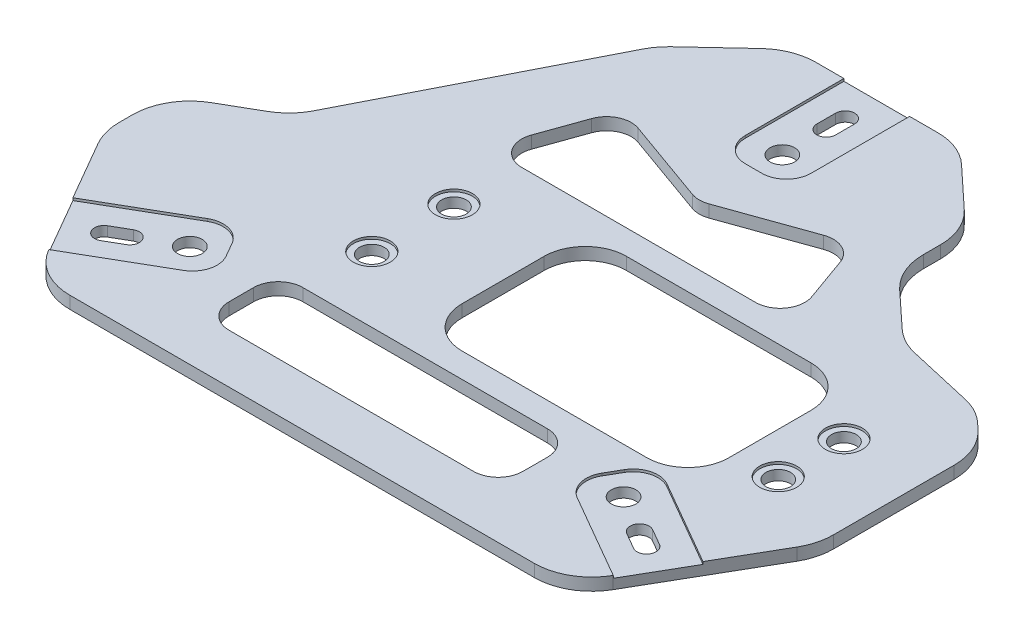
from build123d import *

# Parameters (mm, degrees)
BOSS_EXTRUDE1_DEPTH                     = 0.75
BOSS_EXTRUDE1_DEPTH_BACK                = 0.75
FILLET_7MM_R                            = 7
FILLET_8MM_R                            = 7
GROOVES_START                           = -0.3
GROOVES_DEPTH                           = 61.785535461
SKETCH6_R                               = 1.5
COPPERROD_HOLES_DEPTH                   = 61.478839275
CIRPATTERN1_COUNT                       = 3
SKETCH9_W                               = 32.5
SKETCH9_H                               = 20
SKETCH9_W_2                             = 35.79
SKETCH9_H_2                             = 9
CUT_EXTRUDE3_DEPTH                      = 61.485535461
FILLET_5MM_R                            = 5
FILLET_3MM_R                            = 3
CBORE_FOR_M5_HEX_HEAD_BOLT1_D           = 3
CBORE_FOR_M5_HEX_HEAD_BOLT1_CBORE_D     = 4.5
CBORE_FOR_M5_HEX_HEAD_BOLT1_CBORE_DEPTH = 0.3


with BuildPart() as part:
    # Sketch5 → Boss-Extrude1 (new, two sides: drawn at the far end of the back side and taken through both)
    with BuildSketch(Plane(origin=(0, 0, 0), x_dir=(1, 0, 0), z_dir=(0, 1, 0)).offset(-BOSS_EXTRUDE1_DEPTH_BACK)):
        Polygon((-32.33, -28), (32.33, -28), (43.5, -8.652992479), (43.5, 10.937007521), (39.109866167, 15.114366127), (27.41180038, 17.789297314), (19.417173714, 25.213180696), (19.417173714, 33.393180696), (10.18749, 42), (-10.18749, 42), (-18.785888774, 33.9772113), (-33.80897843, 4.471637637), (-43.5, -1.102992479), (-43.5, -8.652992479), align=None)
    extrude(amount=BOSS_EXTRUDE1_DEPTH + BOSS_EXTRUDE1_DEPTH_BACK)

    # Fillet_7mm
    fillet_7mm_edges = [part.edges().sort_by_distance(p)[0] for p in [
        (-43.5, 0, 8.652992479),
        (-10.18749, 0, -42),
        (10.18749, 0, -42),
        (43.5, 0, -10.937007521),
        (43.5, 0, 8.652992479),
        (32.33, 0, 28),
        (-32.33, 0, 28),
    ]]
    fillet(fillet_7mm_edges, radius=FILLET_7MM_R)

    # Fillet_8mm
    fillet_8mm_edges = [part.edges().sort_by_distance(p)[0] for p in [
        (-43.5, 0, 1.102992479),
        (-33.80897843, 0, -4.471637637),
        (-18.785888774, 0, -33.9772113),
        (19.417173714, 0, -33.393180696),
        (19.417173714, 0, -25.213180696),
        (27.41180038, 0, -17.789297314),
        (39.109866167, 0, -15.114366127),
    ]]
    fillet(fillet_8mm_edges, radius=FILLET_8MM_R)

    # Sketch7 → Grooves (cut)
    with BuildSketch(Plane(origin=(0, 0.75, 0), x_dir=(1, 0, 0), z_dir=(0, 1, 0)).offset(GROOVES_START)):
        with BuildLine():
            Line((-0.999540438, 27.000000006), (0.000376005, 27.000000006))
            Line((0.000376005, 27.000000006), (0.000584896, 42))
            Line((0.000584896, 42), (-3.999206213, 42))
            Line((-3.999206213, 42), (-3.999540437, 30.000083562))
            ThreePointArc((-3.999540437, 30.000083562), (-3.120890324, 27.878709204), (-0.999540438, 27.000000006))
        make_face()
        with BuildLine():
            Line((0.000584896, 42), (0.000376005, 27.000000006))
            Line((0.000376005, 27.000000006), (1.000376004, 27.000000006))
            ThreePointArc((1.000376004, 27.000000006), (3.121696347, 27.878679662), (4.000376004, 30.000000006))
            Line((4.000376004, 30.000000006), (4.000376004, 42))
            Line((4.000376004, 42), (0.000584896, 42))
        make_face()
    grooves = extrude(amount=GROOVES_DEPTH, mode=Mode.SUBTRACT)

    # Sketch6 → CopperRod_Holes (cut, through all)
    with BuildSketch(Plane(origin=(0, 0.45, 0), x_dir=(1, 0, 0), z_dir=(0, 1, 0))):
        with Locations(Location((0, 30.5, 0), (0, 0, 270))):
            Circle(SKETCH6_R)
        with BuildLine():
            Line((1.15, 35.85), (1.15, 38.15))
            ThreePointArc((1.15, 38.15), (0, 39.3), (-1.15, 38.15))
            Line((-1.15, 38.15), (-1.15, 35.85))
            ThreePointArc((-1.15, 35.85), (0, 34.7), (1.15, 35.85))
        make_face()
    copperrod_holes = extrude(amount=-COPPERROD_HOLES_DEPTH, mode=Mode.SUBTRACT)

    # CirPattern1: Grooves, CopperRod_Holes ×3 about axis
    cirpattern1_axis = Axis((0, 0, 0), (0, 1, 0))
    add([grooves.rotate(cirpattern1_axis, i * 360 / CIRPATTERN1_COUNT) for i in range(1, CIRPATTERN1_COUNT)], mode=Mode.SUBTRACT)
    add([copperrod_holes.rotate(cirpattern1_axis, i * 360 / CIRPATTERN1_COUNT) for i in range(1, CIRPATTERN1_COUNT)], mode=Mode.SUBTRACT)

    # Sketch9 → Cut-Extrude3 (cut, through all)
    with BuildSketch(Plane(origin=(0, 0.75, 0), x_dir=(1, 0, 0), z_dir=(0, 1, 0))):
        with Locations((12.75, 0)):
            Rectangle(SKETCH9_W, SKETCH9_H)
        with Locations((0, -17.5)):
            Rectangle(SKETCH9_W_2, SKETCH9_H_2)
        Polygon((-18.5, 13), (18.5, 13), (14.125077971, 25.241734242), (0, 20.193747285), (-14.125077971, 25.241734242), align=None)
    extrude(amount=-CUT_EXTRUDE3_DEPTH, mode=Mode.SUBTRACT)

    # Fillet_5mm
    fillet_5mm_edges = [part.edges().sort_by_distance(p)[0] for p in [
        (-3.5, 0, 10),
        (-3.5, 0, -10),
        (29, 0, -10),
        (29, 0, 10),
    ]]
    fillet(fillet_5mm_edges, radius=FILLET_5MM_R)

    # Fillet_3mm
    fillet_3mm_edges = [part.edges().sort_by_distance(p)[0] for p in [
        (-18.5, 0, -13),
        (-14.125077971, 0, -25.241734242),
        (0, 0, -20.193747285),
        (14.125077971, 0, -25.241734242),
        (18.5, 0, -13),
        (-17.895, 0, 22),
        (-17.895, 0, 13),
        (17.895, 0, 13),
        (17.895, 0, 22),
    ]]
    fillet(fillet_3mm_edges, radius=FILLET_3MM_R)

    # CBORE for M5 Hex Head Bolt1 (through all)
    with Locations(Plane(origin=(-14.5, 0.75, -5), x_dir=(0, 0, 1), z_dir=(0, 1, 0))):
        with Locations((0, 0), (10, 0), (1, 48.5), (9, 48.5)):
            CounterBoreHole(CBORE_FOR_M5_HEX_HEAD_BOLT1_D / 2, CBORE_FOR_M5_HEX_HEAD_BOLT1_CBORE_D / 2, CBORE_FOR_M5_HEX_HEAD_BOLT1_CBORE_DEPTH)


solid = part.part
